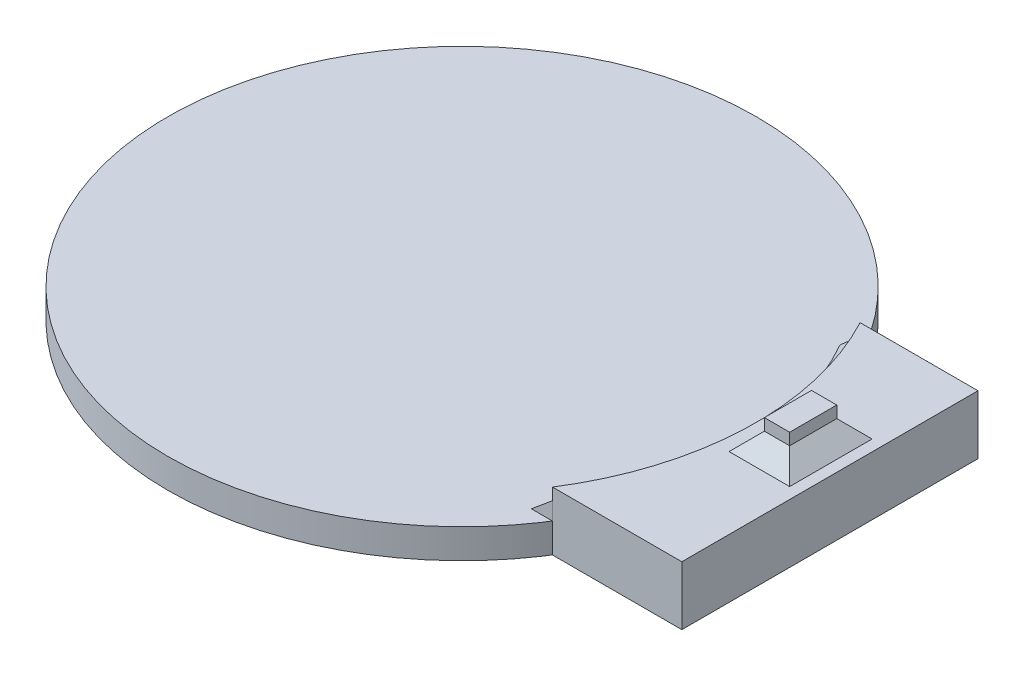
ISO-10303-21;
HEADER;
FILE_DESCRIPTION(('STEP AP214'),'2;1');
FILE_NAME('part.step','',(''),(''),'','','');
FILE_SCHEMA(('AUTOMOTIVE_DESIGN { 1 0 10303 214 1 1 1 1 }'));
ENDSEC;
DATA;
#1=APPLICATION_CONTEXT('core data for automotive mechanical design processes');
#2=APPLICATION_PROTOCOL_DEFINITION('international standard','automotive_design',2000,#1);
#3=PRODUCT_CONTEXT('',#1,'mechanical');
#4=PRODUCT('Part','Part','',(#3));
#5=PRODUCT_RELATED_PRODUCT_CATEGORY('part','',(#4));
#6=PRODUCT_DEFINITION_FORMATION('','',#4);
#7=PRODUCT_DEFINITION_CONTEXT('part definition',#1,'design');
#8=PRODUCT_DEFINITION('design','',#6,#7);
#9=PRODUCT_DEFINITION_SHAPE('','',#8);
#10=(LENGTH_UNIT() NAMED_UNIT(*) SI_UNIT(.MILLI.,.METRE.));
#11=(NAMED_UNIT(*) PLANE_ANGLE_UNIT() SI_UNIT($,.RADIAN.));
#12=(NAMED_UNIT(*) SI_UNIT($,.STERADIAN.) SOLID_ANGLE_UNIT());
#13=UNCERTAINTY_MEASURE_WITH_UNIT(LENGTH_MEASURE(1.E-05),#10,'distance_accuracy_value','');
#14=(GEOMETRIC_REPRESENTATION_CONTEXT(3) GLOBAL_UNCERTAINTY_ASSIGNED_CONTEXT((#13)) GLOBAL_UNIT_ASSIGNED_CONTEXT((#10,
#11,#12)) REPRESENTATION_CONTEXT('',''));
#15=CARTESIAN_POINT('',(0.,0.,0.));
#16=DIRECTION('',(0.,0.,1.));
#17=DIRECTION('',(1.,0.,0.));
#18=AXIS2_PLACEMENT_3D('',#15,#16,#17);
#19=CARTESIAN_POINT('',(51.9713163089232,10.,0.));
#20=DIRECTION('',(0.707106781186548,-0.707106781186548,0.));
#21=DIRECTION('',(0.707106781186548,0.707106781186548,0.));
#22=AXIS2_PLACEMENT_3D('',#19,#20,#21);
#23=PLANE('',#22);
#24=DIRECTION('',(-0.577350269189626,-0.577350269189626,0.577350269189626));
#25=VECTOR('',#24,1.);
#26=CARTESIAN_POINT('',(34.6475442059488,-7.32377210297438,23.9273230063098));
#27=LINE('',#26,#25);
#28=CARTESIAN_POINT('',(54.9713163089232,13.,3.60355090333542));
#29=VERTEX_POINT('',#28);
#30=CARTESIAN_POINT('',(51.9713163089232,10.,6.60355090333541));
#31=VERTEX_POINT('',#30);
#32=EDGE_CURVE('E130',#29,#31,#27,.T.);
#33=ORIENTED_EDGE('',*,*,#32,.F.);
#34=DIRECTION('',(0.,0.,1.));
#35=VECTOR('',#34,1.);
#36=CARTESIAN_POINT('',(54.9713163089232,13.,3.60355090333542));
#37=LINE('',#36,#35);
#38=CARTESIAN_POINT('',(54.9713163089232,13.,-4.40214039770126));
#39=VERTEX_POINT('',#38);
#40=EDGE_CURVE('E51',#39,#29,#37,.T.);
#41=ORIENTED_EDGE('',*,*,#40,.F.);
#42=DIRECTION('',(-0.577350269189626,-0.577350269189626,-0.577350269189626));
#43=VECTOR('',#42,1.);
#44=CARTESIAN_POINT('',(54.4386964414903,12.4673801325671,-4.93476026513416));
#45=LINE('',#44,#43);
#46=CARTESIAN_POINT('',(51.9713163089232,10.,-7.40214039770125));
#47=VERTEX_POINT('',#46);
#48=EDGE_CURVE('E133',#47,#39,#45,.F.);
#49=ORIENTED_EDGE('',*,*,#48,.F.);
#50=DIRECTION('',(0.,0.,-1.));
#51=VECTOR('',#50,1.);
#52=CARTESIAN_POINT('',(51.9713163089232,10.,0.));
#53=LINE('',#52,#51);
#54=EDGE_CURVE('E138',#31,#47,#53,.T.);
#55=ORIENTED_EDGE('',*,*,#54,.F.);
#56=EDGE_LOOP('',(#33,#41,#49,#55));
#57=FACE_BOUND('',#56,.T.);
#58=ADVANCED_FACE('F44',(#57),#23,.F.);
#59=CARTESIAN_POINT('',(0.,10.,-7.40214039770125));
#60=DIRECTION('',(0.,-0.707106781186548,0.707106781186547));
#61=DIRECTION('',(0.,-0.707106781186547,-0.707106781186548));
#62=AXIS2_PLACEMENT_3D('',#59,#60,#61);
#63=PLANE('',#62);
#64=ORIENTED_EDGE('',*,*,#48,.T.);
#65=DIRECTION('',(-1.,0.,0.));
#66=VECTOR('',#65,1.);
#67=CARTESIAN_POINT('',(54.9713163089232,13.,-4.40214039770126));
#68=LINE('',#67,#66);
#69=CARTESIAN_POINT('',(59.2700852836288,13.,-4.40214039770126));
#70=VERTEX_POINT('',#69);
#71=EDGE_CURVE('E145',#70,#39,#68,.T.);
#72=ORIENTED_EDGE('',*,*,#71,.F.);
#73=DIRECTION('',(0.577350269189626,-0.577350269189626,-0.577350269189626));
#74=VECTOR('',#73,1.);
#75=CARTESIAN_POINT('',(41.5133901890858,30.7566950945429,13.3545546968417));
#76=LINE('',#75,#74);
#77=CARTESIAN_POINT('',(62.2700852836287,10.,-7.40214039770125));
#78=VERTEX_POINT('',#77);
#79=EDGE_CURVE('E127',#78,#70,#76,.F.);
#80=ORIENTED_EDGE('',*,*,#79,.F.);
#81=DIRECTION('',(1.,0.,0.));
#82=VECTOR('',#81,1.);
#83=CARTESIAN_POINT('',(0.,10.,-7.40214039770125));
#84=LINE('',#83,#82);
#85=EDGE_CURVE('E65',#47,#78,#84,.T.);
#86=ORIENTED_EDGE('',*,*,#85,.F.);
#87=EDGE_LOOP('',(#64,#72,#80,#86));
#88=FACE_BOUND('',#87,.T.);
#89=ADVANCED_FACE('F165',(#88),#63,.F.);
#90=CARTESIAN_POINT('',(0.,10.,6.60355090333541));
#91=DIRECTION('',(0.,-0.707106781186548,-0.707106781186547));
#92=DIRECTION('',(0.,0.707106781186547,-0.707106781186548));
#93=AXIS2_PLACEMENT_3D('',#90,#91,#92);
#94=PLANE('',#93);
#95=ORIENTED_EDGE('',*,*,#32,.T.);
#96=DIRECTION('',(-1.,0.,0.));
#97=VECTOR('',#96,1.);
#98=CARTESIAN_POINT('',(0.,10.,6.60355090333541));
#99=LINE('',#98,#97);
#100=CARTESIAN_POINT('',(62.2700852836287,10.,6.60355090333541));
#101=VERTEX_POINT('',#100);
#102=EDGE_CURVE('E136',#101,#31,#99,.T.);
#103=ORIENTED_EDGE('',*,*,#102,.F.);
#104=DIRECTION('',(-0.577350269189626,0.577350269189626,-0.577350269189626));
#105=VECTOR('',#104,1.);
#106=CARTESIAN_POINT('',(41.5133901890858,30.7566950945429,-14.1531441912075));
#107=LINE('',#106,#105);
#108=CARTESIAN_POINT('',(59.2700852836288,13.,3.60355090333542));
#109=VERTEX_POINT('',#108);
#110=EDGE_CURVE('E124',#109,#101,#107,.F.);
#111=ORIENTED_EDGE('',*,*,#110,.F.);
#112=DIRECTION('',(1.,0.,0.));
#113=VECTOR('',#112,1.);
#114=CARTESIAN_POINT('',(54.9713163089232,13.,3.60355090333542));
#115=LINE('',#114,#113);
#116=EDGE_CURVE('E12',#29,#109,#115,.T.);
#117=ORIENTED_EDGE('',*,*,#116,.F.);
#118=EDGE_LOOP('',(#95,#103,#111,#117));
#119=FACE_BOUND('',#118,.T.);
#120=ADVANCED_FACE('F157',(#119),#94,.F.);
#121=CARTESIAN_POINT('',(62.2700852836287,10.,0.));
#122=DIRECTION('',(-0.707106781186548,-0.707106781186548,0.));
#123=DIRECTION('',(0.707106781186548,-0.707106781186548,0.));
#124=AXIS2_PLACEMENT_3D('',#121,#122,#123);
#125=PLANE('',#124);
#126=ORIENTED_EDGE('',*,*,#79,.T.);
#127=DIRECTION('',(0.,0.,-1.));
#128=VECTOR('',#127,1.);
#129=CARTESIAN_POINT('',(59.2700852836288,13.,3.60355090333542));
#130=LINE('',#129,#128);
#131=EDGE_CURVE('E143',#109,#70,#130,.T.);
#132=ORIENTED_EDGE('',*,*,#131,.F.);
#133=ORIENTED_EDGE('',*,*,#110,.T.);
#134=DIRECTION('',(0.,0.,1.));
#135=VECTOR('',#134,1.);
#136=CARTESIAN_POINT('',(62.2700852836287,10.,0.));
#137=LINE('',#136,#135);
#138=EDGE_CURVE('E141',#78,#101,#137,.T.);
#139=ORIENTED_EDGE('',*,*,#138,.F.);
#140=EDGE_LOOP('',(#126,#132,#133,#139));
#141=FACE_BOUND('',#140,.T.);
#142=ADVANCED_FACE('F160',(#141),#125,.F.);
#143=CARTESIAN_POINT('',(54.9713163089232,15.,3.60355090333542));
#144=DIRECTION('',(1.,0.,0.));
#145=DIRECTION('',(0.,0.,-1.));
#146=AXIS2_PLACEMENT_3D('',#143,#144,#145);
#147=PLANE('',#146);
#148=ORIENTED_EDGE('',*,*,#40,.T.);
#149=DIRECTION('',(0.,-1.,0.));
#150=VECTOR('',#149,1.);
#151=CARTESIAN_POINT('',(54.9713163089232,15.,3.60355090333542));
#152=LINE('',#151,#150);
#153=CARTESIAN_POINT('',(54.9713163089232,10.,3.60355090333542));
#154=VERTEX_POINT('',#153);
#155=EDGE_CURVE('E100',#29,#154,#152,.T.);
#156=ORIENTED_EDGE('',*,*,#155,.T.);
#157=DIRECTION('',(0.,0.,-1.));
#158=VECTOR('',#157,1.);
#159=CARTESIAN_POINT('',(54.9713163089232,10.,0.));
#160=LINE('',#159,#158);
#161=CARTESIAN_POINT('',(54.9713163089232,10.,-4.40214039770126));
#162=VERTEX_POINT('',#161);
#163=EDGE_CURVE('E111',#154,#162,#160,.T.);
#164=ORIENTED_EDGE('',*,*,#163,.T.);
#165=DIRECTION('',(0.,-1.,0.));
#166=VECTOR('',#165,1.);
#167=CARTESIAN_POINT('',(54.9713163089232,15.,-4.40214039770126));
#168=LINE('',#167,#166);
#169=EDGE_CURVE('E121',#39,#162,#168,.T.);
#170=ORIENTED_EDGE('',*,*,#169,.F.);
#171=EDGE_LOOP('',(#148,#156,#164,#170));
#172=FACE_BOUND('',#171,.T.);
#173=ADVANCED_FACE('F149',(#172),#147,.T.);
#174=CARTESIAN_POINT('',(54.9713163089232,15.,-4.40214039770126));
#175=DIRECTION('',(0.,0.,1.));
#176=DIRECTION('',(1.,0.,0.));
#177=AXIS2_PLACEMENT_3D('',#174,#175,#176);
#178=PLANE('',#177);
#179=ORIENTED_EDGE('',*,*,#71,.T.);
#180=ORIENTED_EDGE('',*,*,#169,.T.);
#181=DIRECTION('',(1.,0.,0.));
#182=VECTOR('',#181,1.);
#183=CARTESIAN_POINT('',(0.,10.,-4.40214039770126));
#184=LINE('',#183,#182);
#185=CARTESIAN_POINT('',(59.2700852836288,10.,-4.40214039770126));
#186=VERTEX_POINT('',#185);
#187=EDGE_CURVE('E115',#162,#186,#184,.T.);
#188=ORIENTED_EDGE('',*,*,#187,.T.);
#189=DIRECTION('',(0.,-1.,0.));
#190=VECTOR('',#189,1.);
#191=CARTESIAN_POINT('',(59.2700852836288,15.,-4.40214039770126));
#192=LINE('',#191,#190);
#193=EDGE_CURVE('E101',#70,#186,#192,.T.);
#194=ORIENTED_EDGE('',*,*,#193,.F.);
#195=EDGE_LOOP('',(#179,#180,#188,#194));
#196=FACE_BOUND('',#195,.T.);
#197=ADVANCED_FACE('F163',(#196),#178,.T.);
#198=CARTESIAN_POINT('',(54.9713163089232,15.,3.60355090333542));
#199=DIRECTION('',(0.,0.,-1.));
#200=DIRECTION('',(-1.,0.,0.));
#201=AXIS2_PLACEMENT_3D('',#198,#199,#200);
#202=PLANE('',#201);
#203=ORIENTED_EDGE('',*,*,#116,.T.);
#204=DIRECTION('',(0.,-1.,0.));
#205=VECTOR('',#204,1.);
#206=CARTESIAN_POINT('',(59.2700852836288,15.,3.60355090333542));
#207=LINE('',#206,#205);
#208=CARTESIAN_POINT('',(59.2700852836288,10.,3.60355090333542));
#209=VERTEX_POINT('',#208);
#210=EDGE_CURVE('E58',#109,#209,#207,.T.);
#211=ORIENTED_EDGE('',*,*,#210,.T.);
#212=DIRECTION('',(-1.,0.,0.));
#213=VECTOR('',#212,1.);
#214=CARTESIAN_POINT('',(0.,10.,3.60355090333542));
#215=LINE('',#214,#213);
#216=EDGE_CURVE('E97',#209,#154,#215,.T.);
#217=ORIENTED_EDGE('',*,*,#216,.T.);
#218=ORIENTED_EDGE('',*,*,#155,.F.);
#219=EDGE_LOOP('',(#203,#211,#217,#218));
#220=FACE_BOUND('',#219,.T.);
#221=ADVANCED_FACE('F95',(#220),#202,.T.);
#222=CARTESIAN_POINT('',(0.,10.,0.));
#223=DIRECTION('',(0.,1.,0.));
#224=DIRECTION('',(0.,0.,1.));
#225=AXIS2_PLACEMENT_3D('',#222,#223,#224);
#226=PLANE('',#225);
#227=ORIENTED_EDGE('',*,*,#216,.F.);
#228=DIRECTION('',(0.,0.,1.));
#229=VECTOR('',#228,1.);
#230=CARTESIAN_POINT('',(59.2700852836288,10.,0.));
#231=LINE('',#230,#229);
#232=EDGE_CURVE('E108',#186,#209,#231,.T.);
#233=ORIENTED_EDGE('',*,*,#232,.F.);
#234=ORIENTED_EDGE('',*,*,#187,.F.);
#235=ORIENTED_EDGE('',*,*,#163,.F.);
#236=EDGE_LOOP('',(#227,#233,#234,#235));
#237=FACE_BOUND('',#236,.T.);
#238=ORIENTED_EDGE('',*,*,#85,.T.);
#239=ORIENTED_EDGE('',*,*,#138,.T.);
#240=ORIENTED_EDGE('',*,*,#102,.T.);
#241=ORIENTED_EDGE('',*,*,#54,.T.);
#242=EDGE_LOOP('',(#238,#239,#240,#241));
#243=FACE_BOUND('',#242,.T.);
#244=ADVANCED_FACE('F106',(#237,#243),#226,.F.);
#245=CARTESIAN_POINT('',(59.2700852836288,15.,3.60355090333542));
#246=DIRECTION('',(-1.,0.,0.));
#247=DIRECTION('',(0.,0.,1.));
#248=AXIS2_PLACEMENT_3D('',#245,#246,#247);
#249=PLANE('',#248);
#250=ORIENTED_EDGE('',*,*,#131,.T.);
#251=ORIENTED_EDGE('',*,*,#193,.T.);
#252=ORIENTED_EDGE('',*,*,#232,.T.);
#253=ORIENTED_EDGE('',*,*,#210,.F.);
#254=EDGE_LOOP('',(#250,#251,#252,#253));
#255=FACE_BOUND('',#254,.T.);
#256=ADVANCED_FACE('F113',(#255),#249,.T.);
#257=CLOSED_SHELL('',(#58,#89,#120,#142,#173,#197,#221,#244,#256));
#258=MANIFOLD_SOLID_BREP('B2',#257);
#259=CARTESIAN_POINT('',(64.1693493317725,10.,-23.5001463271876));
#260=DIRECTION('',(0.,0.,1.));
#261=DIRECTION('',(1.,0.,0.));
#262=AXIS2_PLACEMENT_3D('',#259,#260,#261);
#263=PLANE('',#262);
#264=DIRECTION('',(0.,-1.,0.));
#265=VECTOR('',#264,1.);
#266=CARTESIAN_POINT('',(44.1332428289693,10.,-23.5001463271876));
#267=LINE('',#266,#265);
#268=CARTESIAN_POINT('',(44.1332428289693,7.99999999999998,-23.5001463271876));
#269=VERTEX_POINT('',#268);
#270=CARTESIAN_POINT('',(44.1332428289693,5.,-23.5001463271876));
#271=VERTEX_POINT('',#270);
#272=EDGE_CURVE('E269',#269,#271,#267,.T.);
#273=ORIENTED_EDGE('',*,*,#272,.T.);
#274=DIRECTION('',(1.,0.,0.));
#275=VECTOR('',#274,1.);
#276=CARTESIAN_POINT('',(0.,5.,-23.5001463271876));
#277=LINE('',#276,#275);
#278=CARTESIAN_POINT('',(40.7031094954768,5.,-23.5001463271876));
#279=VERTEX_POINT('',#278);
#280=EDGE_CURVE('E288',#279,#271,#277,.T.);
#281=ORIENTED_EDGE('',*,*,#280,.F.);
#282=CARTESIAN_POINT('',(40.7031094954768,5.,-23.5001463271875));
#283=CARTESIAN_POINT('',(40.9901723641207,5.2486040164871,-23.5001463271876));
#284=CARTESIAN_POINT('',(41.27691054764,5.49758274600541,-23.5001463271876));
#285=CARTESIAN_POINT('',(41.8497667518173,5.99624945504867,-23.5001463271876));
#286=CARTESIAN_POINT('',(42.1358847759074,6.24593743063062,-23.5001463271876));
#287=CARTESIAN_POINT('',(42.7075329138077,6.74598509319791,-23.5001463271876));
#288=CARTESIAN_POINT('',(42.9930630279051,6.99634477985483,-23.5001463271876));
#289=CARTESIAN_POINT('',(43.5635650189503,7.49770259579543,-23.5001463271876));
#290=CARTESIAN_POINT('',(43.848536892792,7.74870072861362,-23.5001463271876));
#291=CARTESIAN_POINT('',(44.1332428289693,7.99999999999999,-23.5001463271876));
#292=B_SPLINE_CURVE_WITH_KNOTS('',3,(#282,#283,#284,#285,#286,#287,#288,#289,#290,#291),
.UNSPECIFIED.,.F.,.F.,(4,2,2,2,4),(0.,1.13924547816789,2.27848463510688,3.4177232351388,
4.55696815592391),.UNSPECIFIED.);
#293=EDGE_CURVE('E262',#279,#269,#292,.T.);
#294=ORIENTED_EDGE('',*,*,#293,.T.);
#295=EDGE_LOOP('',(#273,#281,#294));
#296=FACE_BOUND('',#295,.T.);
#297=ADVANCED_FACE('F249',(#296),#263,.F.);
#298=CARTESIAN_POINT('',(64.1693493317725,10.,26.8266510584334));
#299=DIRECTION('',(0.,0.,-1.));
#300=DIRECTION('',(-1.,0.,0.));
#301=AXIS2_PLACEMENT_3D('',#298,#299,#300);
#302=PLANE('',#301);
#303=DIRECTION('',(0.,-1.,0.));
#304=VECTOR('',#303,1.);
#305=CARTESIAN_POINT('',(42.1939663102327,10.,26.8266510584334));
#306=LINE('',#305,#304);
#307=CARTESIAN_POINT('',(42.1939663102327,7.99999999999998,26.8266510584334));
#308=VERTEX_POINT('',#307);
#309=CARTESIAN_POINT('',(42.1939663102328,5.,26.8266510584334));
#310=VERTEX_POINT('',#309);
#311=EDGE_CURVE('E299',#308,#310,#306,.T.);
#312=ORIENTED_EDGE('',*,*,#311,.F.);
#313=CARTESIAN_POINT('',(42.1939663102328,7.99999999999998,26.8266510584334));
#314=CARTESIAN_POINT('',(41.8954121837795,7.74805735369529,26.8266510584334));
#315=CARTESIAN_POINT('',(41.5964794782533,7.49656298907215,26.8266510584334));
#316=CARTESIAN_POINT('',(40.9978197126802,6.994528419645,26.8266510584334));
#317=CARTESIAN_POINT('',(40.6980926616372,6.74398820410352,26.8266510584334));
#318=CARTESIAN_POINT('',(40.0977999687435,6.24391358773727,26.8266510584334));
#319=CARTESIAN_POINT('',(39.7972343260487,5.99437918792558,26.8266510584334));
#320=CARTESIAN_POINT('',(39.1952166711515,5.49637503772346,26.8266510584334));
#321=CARTESIAN_POINT('',(38.8937646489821,5.24790529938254,26.8266510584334));
#322=CARTESIAN_POINT('',(38.5918487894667,5.00000000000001,26.8266510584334));
#323=B_SPLINE_CURVE_WITH_KNOTS('',3,(#313,#314,#315,#316,#317,#318,#319,#320,#321,#322),
.UNSPECIFIED.,.F.,.F.,(4,2,2,2,4),(0.,1.17195847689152,2.3439037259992,3.51585015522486,
4.68780981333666),.UNSPECIFIED.);
#324=CARTESIAN_POINT('',(38.5918487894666,5.,26.8266510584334));
#325=VERTEX_POINT('',#324);
#326=EDGE_CURVE('E42',#308,#325,#323,.T.);
#327=ORIENTED_EDGE('',*,*,#326,.T.);
#328=DIRECTION('',(-1.,0.,0.));
#329=VECTOR('',#328,1.);
#330=CARTESIAN_POINT('',(0.,5.,26.8266510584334));
#331=LINE('',#330,#329);
#332=EDGE_CURVE('E277',#310,#325,#331,.T.);
#333=ORIENTED_EDGE('',*,*,#332,.F.);
#334=EDGE_LOOP('',(#312,#327,#333));
#335=FACE_BOUND('',#334,.T.);
#336=ADVANCED_FACE('F251',(#335),#302,.F.);
#337=CARTESIAN_POINT('',(0.,5.,0.));
#338=DIRECTION('',(0.,1.,0.));
#339=DIRECTION('',(0.,0.,1.));
#340=AXIS2_PLACEMENT_3D('',#337,#338,#339);
#341=CONICAL_SURFACE('',#340,47.,0.785398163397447);
#342=ORIENTED_EDGE('',*,*,#326,.F.);
#343=CARTESIAN_POINT('',(0.,7.99999999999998,0.));
#344=DIRECTION('',(0.,1.,0.));
#345=DIRECTION('',(0.,0.,1.));
#346=AXIS2_PLACEMENT_3D('',#343,#344,#345);
#347=CIRCLE('',#346,50.);
#348=EDGE_CURVE('E295',#269,#308,#347,.F.);
#349=ORIENTED_EDGE('',*,*,#348,.F.);
#350=ORIENTED_EDGE('',*,*,#293,.F.);
#351=CARTESIAN_POINT('',(0.,5.,0.));
#352=DIRECTION('',(0.,1.,0.));
#353=DIRECTION('',(0.,0.,1.));
#354=AXIS2_PLACEMENT_3D('',#351,#352,#353);
#355=CIRCLE('',#354,47.);
#356=EDGE_CURVE('E292',#325,#279,#355,.T.);
#357=ORIENTED_EDGE('',*,*,#356,.F.);
#358=EDGE_LOOP('',(#342,#349,#350,#357));
#359=FACE_BOUND('',#358,.T.);
#360=ADVANCED_FACE('F311',(#359),#341,.F.);
#361=CARTESIAN_POINT('',(0.,5.,0.));
#362=DIRECTION('',(0.,1.,0.));
#363=DIRECTION('',(0.,0.,1.));
#364=AXIS2_PLACEMENT_3D('',#361,#362,#363);
#365=PLANE('',#364);
#366=CARTESIAN_POINT('',(0.,5.,0.));
#367=DIRECTION('',(0.,1.,0.));
#368=DIRECTION('',(0.,0.,1.));
#369=AXIS2_PLACEMENT_3D('',#366,#367,#368);
#370=CIRCLE('',#369,50.);
#371=EDGE_CURVE('E290',#310,#271,#370,.T.);
#372=ORIENTED_EDGE('',*,*,#371,.F.);
#373=ORIENTED_EDGE('',*,*,#332,.T.);
#374=ORIENTED_EDGE('',*,*,#356,.T.);
#375=ORIENTED_EDGE('',*,*,#280,.T.);
#376=EDGE_LOOP('',(#372,#373,#374,#375));
#377=FACE_BOUND('',#376,.T.);
#378=ADVANCED_FACE('F289',(#377),#365,.F.);
#379=CARTESIAN_POINT('',(0.,10.,0.));
#380=DIRECTION('',(0.,-1.,0.));
#381=DIRECTION('',(0.,0.,-1.));
#382=AXIS2_PLACEMENT_3D('',#379,#380,#381);
#383=CYLINDRICAL_SURFACE('',#382,50.);
#384=ORIENTED_EDGE('',*,*,#348,.T.);
#385=ORIENTED_EDGE('',*,*,#311,.T.);
#386=ORIENTED_EDGE('',*,*,#371,.T.);
#387=ORIENTED_EDGE('',*,*,#272,.F.);
#388=EDGE_LOOP('',(#384,#385,#386,#387));
#389=FACE_BOUND('',#388,.T.);
#390=ADVANCED_FACE('F297',(#389),#383,.T.);
#391=CLOSED_SHELL('',(#297,#336,#360,#378,#390));
#392=MANIFOLD_SOLID_BREP('B6',#391);
#393=CARTESIAN_POINT('',(54.9713163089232,15.,3.60355090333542));
#394=DIRECTION('',(1.,0.,0.));
#395=DIRECTION('',(0.,0.,-1.));
#396=AXIS2_PLACEMENT_3D('',#393,#394,#395);
#397=PLANE('',#396);
#398=DIRECTION('',(0.,0.,1.));
#399=VECTOR('',#398,1.);
#400=CARTESIAN_POINT('',(54.9713163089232,10.,3.60355090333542));
#401=LINE('',#400,#399);
#402=CARTESIAN_POINT('',(54.9713163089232,10.,-4.40214039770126));
#403=VERTEX_POINT('',#402);
#404=CARTESIAN_POINT('',(54.9713163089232,10.,3.60355090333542));
#405=VERTEX_POINT('',#404);
#406=EDGE_CURVE('E411',#403,#405,#401,.T.);
#407=ORIENTED_EDGE('',*,*,#406,.T.);
#408=DIRECTION('',(0.,-1.,0.));
#409=VECTOR('',#408,1.);
#410=CARTESIAN_POINT('',(54.9713163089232,15.,3.60355090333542));
#411=LINE('',#410,#409);
#412=CARTESIAN_POINT('',(54.9713163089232,15.,3.60355090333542));
#413=VERTEX_POINT('',#412);
#414=EDGE_CURVE('E247',#413,#405,#411,.T.);
#415=ORIENTED_EDGE('',*,*,#414,.F.);
#416=DIRECTION('',(0.,0.,1.));
#417=VECTOR('',#416,1.);
#418=CARTESIAN_POINT('',(54.9713163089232,15.,3.60355090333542));
#419=LINE('',#418,#417);
#420=CARTESIAN_POINT('',(54.9713163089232,15.,-4.40214039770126));
#421=VERTEX_POINT('',#420);
#422=EDGE_CURVE('E429',#421,#413,#419,.T.);
#423=ORIENTED_EDGE('',*,*,#422,.F.);
#424=DIRECTION('',(0.,-1.,0.));
#425=VECTOR('',#424,1.);
#426=CARTESIAN_POINT('',(54.9713163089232,15.,-4.40214039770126));
#427=LINE('',#426,#425);
#428=EDGE_CURVE('E423',#421,#403,#427,.T.);
#429=ORIENTED_EDGE('',*,*,#428,.T.);
#430=EDGE_LOOP('',(#407,#415,#423,#429));
#431=FACE_BOUND('',#430,.T.);
#432=ADVANCED_FACE('F367',(#431),#397,.F.);
#433=CARTESIAN_POINT('',(54.9713163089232,15.,3.60355090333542));
#434=DIRECTION('',(0.,0.,-1.));
#435=DIRECTION('',(-1.,0.,0.));
#436=AXIS2_PLACEMENT_3D('',#433,#434,#435);
#437=PLANE('',#436);
#438=DIRECTION('',(1.,0.,0.));
#439=VECTOR('',#438,1.);
#440=CARTESIAN_POINT('',(54.9713163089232,10.,3.60355090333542));
#441=LINE('',#440,#439);
#442=CARTESIAN_POINT('',(59.2700852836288,10.,3.60355090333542));
#443=VERTEX_POINT('',#442);
#444=EDGE_CURVE('E407',#405,#443,#441,.T.);
#445=ORIENTED_EDGE('',*,*,#444,.T.);
#446=DIRECTION('',(0.,-1.,0.));
#447=VECTOR('',#446,1.);
#448=CARTESIAN_POINT('',(59.2700852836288,15.,3.60355090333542));
#449=LINE('',#448,#447);
#450=CARTESIAN_POINT('',(59.2700852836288,15.,3.60355090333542));
#451=VERTEX_POINT('',#450);
#452=EDGE_CURVE('E374',#451,#443,#449,.T.);
#453=ORIENTED_EDGE('',*,*,#452,.F.);
#454=DIRECTION('',(1.,0.,0.));
#455=VECTOR('',#454,1.);
#456=CARTESIAN_POINT('',(54.9713163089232,15.,3.60355090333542));
#457=LINE('',#456,#455);
#458=EDGE_CURVE('E419',#413,#451,#457,.T.);
#459=ORIENTED_EDGE('',*,*,#458,.F.);
#460=ORIENTED_EDGE('',*,*,#414,.T.);
#461=EDGE_LOOP('',(#445,#453,#459,#460));
#462=FACE_BOUND('',#461,.T.);
#463=ADVANCED_FACE('F418',(#462),#437,.F.);
#464=CARTESIAN_POINT('',(59.2700852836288,15.,3.60355090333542));
#465=DIRECTION('',(-1.,0.,0.));
#466=DIRECTION('',(0.,0.,1.));
#467=AXIS2_PLACEMENT_3D('',#464,#465,#466);
#468=PLANE('',#467);
#469=DIRECTION('',(0.,0.,-1.));
#470=VECTOR('',#469,1.);
#471=CARTESIAN_POINT('',(59.2700852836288,10.,3.60355090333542));
#472=LINE('',#471,#470);
#473=CARTESIAN_POINT('',(59.2700852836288,10.,-4.40214039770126));
#474=VERTEX_POINT('',#473);
#475=EDGE_CURVE('E412',#443,#474,#472,.T.);
#476=ORIENTED_EDGE('',*,*,#475,.T.);
#477=DIRECTION('',(0.,-1.,0.));
#478=VECTOR('',#477,1.);
#479=CARTESIAN_POINT('',(59.2700852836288,15.,-4.40214039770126));
#480=LINE('',#479,#478);
#481=CARTESIAN_POINT('',(59.2700852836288,15.,-4.40214039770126));
#482=VERTEX_POINT('',#481);
#483=EDGE_CURVE('E435',#482,#474,#480,.T.);
#484=ORIENTED_EDGE('',*,*,#483,.F.);
#485=DIRECTION('',(0.,0.,-1.));
#486=VECTOR('',#485,1.);
#487=CARTESIAN_POINT('',(59.2700852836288,15.,3.60355090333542));
#488=LINE('',#487,#486);
#489=EDGE_CURVE('E386',#451,#482,#488,.T.);
#490=ORIENTED_EDGE('',*,*,#489,.F.);
#491=ORIENTED_EDGE('',*,*,#452,.T.);
#492=EDGE_LOOP('',(#476,#484,#490,#491));
#493=FACE_BOUND('',#492,.T.);
#494=ADVANCED_FACE('F438',(#493),#468,.F.);
#495=CARTESIAN_POINT('',(54.9713163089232,15.,-4.40214039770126));
#496=DIRECTION('',(0.,0.,1.));
#497=DIRECTION('',(1.,0.,0.));
#498=AXIS2_PLACEMENT_3D('',#495,#496,#497);
#499=PLANE('',#498);
#500=DIRECTION('',(-1.,0.,0.));
#501=VECTOR('',#500,1.);
#502=CARTESIAN_POINT('',(54.9713163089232,10.,-4.40214039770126));
#503=LINE('',#502,#501);
#504=EDGE_CURVE('E427',#474,#403,#503,.T.);
#505=ORIENTED_EDGE('',*,*,#504,.T.);
#506=ORIENTED_EDGE('',*,*,#428,.F.);
#507=DIRECTION('',(-1.,0.,0.));
#508=VECTOR('',#507,1.);
#509=CARTESIAN_POINT('',(54.9713163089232,15.,-4.40214039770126));
#510=LINE('',#509,#508);
#511=EDGE_CURVE('E381',#482,#421,#510,.T.);
#512=ORIENTED_EDGE('',*,*,#511,.F.);
#513=ORIENTED_EDGE('',*,*,#483,.T.);
#514=EDGE_LOOP('',(#505,#506,#512,#513));
#515=FACE_BOUND('',#514,.T.);
#516=ADVANCED_FACE('F440',(#515),#499,.F.);
#517=CARTESIAN_POINT('',(54.9713163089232,15.,-4.40214039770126));
#518=DIRECTION('',(0.,-1.,0.));
#519=DIRECTION('',(0.,0.,-1.));
#520=AXIS2_PLACEMENT_3D('',#517,#518,#519);
#521=PLANE('',#520);
#522=ORIENTED_EDGE('',*,*,#422,.T.);
#523=ORIENTED_EDGE('',*,*,#458,.T.);
#524=ORIENTED_EDGE('',*,*,#489,.T.);
#525=ORIENTED_EDGE('',*,*,#511,.T.);
#526=EDGE_LOOP('',(#522,#523,#524,#525));
#527=FACE_BOUND('',#526,.T.);
#528=ADVANCED_FACE('F441',(#527),#521,.F.);
#529=CARTESIAN_POINT('',(54.9713163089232,10.,-4.40214039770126));
#530=DIRECTION('',(0.,-1.,0.));
#531=DIRECTION('',(0.,0.,-1.));
#532=AXIS2_PLACEMENT_3D('',#529,#530,#531);
#533=PLANE('',#532);
#534=ORIENTED_EDGE('',*,*,#406,.F.);
#535=ORIENTED_EDGE('',*,*,#504,.F.);
#536=ORIENTED_EDGE('',*,*,#475,.F.);
#537=ORIENTED_EDGE('',*,*,#444,.F.);
#538=EDGE_LOOP('',(#534,#535,#536,#537));
#539=FACE_BOUND('',#538,.T.);
#540=ADVANCED_FACE('F408',(#539),#533,.T.);
#541=CLOSED_SHELL('',(#432,#463,#494,#516,#528,#540));
#542=MANIFOLD_SOLID_BREP('B36',#541);
#543=CARTESIAN_POINT('',(64.1693493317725,10.,-23.5001463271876));
#544=DIRECTION('',(-1.,0.,0.));
#545=DIRECTION('',(0.,0.,1.));
#546=AXIS2_PLACEMENT_3D('',#543,#544,#545);
#547=PLANE('',#546);
#548=DIRECTION('',(0.,0.,-1.));
#549=VECTOR('',#548,1.);
#550=CARTESIAN_POINT('',(64.1693493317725,0.,-23.5001463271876));
#551=LINE('',#550,#549);
#552=CARTESIAN_POINT('',(64.1693493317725,0.,26.8266510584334));
#553=VERTEX_POINT('',#552);
#554=CARTESIAN_POINT('',(64.1693493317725,0.,-23.5001463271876));
#555=VERTEX_POINT('',#554);
#556=EDGE_CURVE('E542',#553,#555,#551,.T.);
#557=ORIENTED_EDGE('',*,*,#556,.T.);
#558=DIRECTION('',(0.,-1.,0.));
#559=VECTOR('',#558,1.);
#560=CARTESIAN_POINT('',(64.1693493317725,10.,-23.5001463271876));
#561=LINE('',#560,#559);
#562=CARTESIAN_POINT('',(64.1693493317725,10.,-23.5001463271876));
#563=VERTEX_POINT('',#562);
#564=EDGE_CURVE('E365',#563,#555,#561,.T.);
#565=ORIENTED_EDGE('',*,*,#564,.F.);
#566=DIRECTION('',(0.,0.,-1.));
#567=VECTOR('',#566,1.);
#568=CARTESIAN_POINT('',(64.1693493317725,10.,-23.5001463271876));
#569=LINE('',#568,#567);
#570=CARTESIAN_POINT('',(64.1693493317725,10.,26.8266510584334));
#571=VERTEX_POINT('',#570);
#572=EDGE_CURVE('E560',#571,#563,#569,.T.);
#573=ORIENTED_EDGE('',*,*,#572,.F.);
#574=DIRECTION('',(0.,-1.,0.));
#575=VECTOR('',#574,1.);
#576=CARTESIAN_POINT('',(64.1693493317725,10.,26.8266510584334));
#577=LINE('',#576,#575);
#578=EDGE_CURVE('E554',#571,#553,#577,.T.);
#579=ORIENTED_EDGE('',*,*,#578,.T.);
#580=EDGE_LOOP('',(#557,#565,#573,#579));
#581=FACE_BOUND('',#580,.T.);
#582=ADVANCED_FACE('F498',(#581),#547,.F.);
#583=CARTESIAN_POINT('',(64.1693493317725,10.,-23.5001463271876));
#584=DIRECTION('',(0.,0.,1.));
#585=DIRECTION('',(1.,0.,0.));
#586=AXIS2_PLACEMENT_3D('',#583,#584,#585);
#587=PLANE('',#586);
#588=DIRECTION('',(-1.,0.,0.));
#589=VECTOR('',#588,1.);
#590=CARTESIAN_POINT('',(64.1693493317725,0.,-23.5001463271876));
#591=LINE('',#590,#589);
#592=CARTESIAN_POINT('',(44.1332428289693,0.,-23.5001463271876));
#593=VERTEX_POINT('',#592);
#594=EDGE_CURVE('E538',#555,#593,#591,.T.);
#595=ORIENTED_EDGE('',*,*,#594,.T.);
#596=DIRECTION('',(0.,-1.,0.));
#597=VECTOR('',#596,1.);
#598=CARTESIAN_POINT('',(44.1332428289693,10.,-23.5001463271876));
#599=LINE('',#598,#597);
#600=CARTESIAN_POINT('',(44.1332428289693,10.,-23.5001463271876));
#601=VERTEX_POINT('',#600);
#602=EDGE_CURVE('E505',#601,#593,#599,.T.);
#603=ORIENTED_EDGE('',*,*,#602,.F.);
#604=DIRECTION('',(-1.,0.,0.));
#605=VECTOR('',#604,1.);
#606=CARTESIAN_POINT('',(64.1693493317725,10.,-23.5001463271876));
#607=LINE('',#606,#605);
#608=EDGE_CURVE('E550',#563,#601,#607,.T.);
#609=ORIENTED_EDGE('',*,*,#608,.F.);
#610=ORIENTED_EDGE('',*,*,#564,.T.);
#611=EDGE_LOOP('',(#595,#603,#609,#610));
#612=FACE_BOUND('',#611,.T.);
#613=ADVANCED_FACE('F549',(#612),#587,.F.);
#614=CARTESIAN_POINT('',(0.,10.,0.));
#615=DIRECTION('',(0.,-1.,0.));
#616=DIRECTION('',(0.,0.,-1.));
#617=AXIS2_PLACEMENT_3D('',#614,#615,#616);
#618=CYLINDRICAL_SURFACE('',#617,50.);
#619=CARTESIAN_POINT('',(0.,0.,0.));
#620=DIRECTION('',(0.,-1.,0.));
#621=DIRECTION('',(0.,0.,1.));
#622=AXIS2_PLACEMENT_3D('',#619,#620,#621);
#623=CIRCLE('',#622,50.);
#624=CARTESIAN_POINT('',(42.1939663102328,0.,26.8266510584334));
#625=VERTEX_POINT('',#624);
#626=EDGE_CURVE('E543',#593,#625,#623,.T.);
#627=ORIENTED_EDGE('',*,*,#626,.T.);
#628=DIRECTION('',(0.,-1.,0.));
#629=VECTOR('',#628,1.);
#630=CARTESIAN_POINT('',(42.1939663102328,10.,26.8266510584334));
#631=LINE('',#630,#629);
#632=CARTESIAN_POINT('',(42.1939663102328,10.,26.8266510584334));
#633=VERTEX_POINT('',#632);
#634=EDGE_CURVE('E566',#633,#625,#631,.T.);
#635=ORIENTED_EDGE('',*,*,#634,.F.);
#636=CARTESIAN_POINT('',(0.,10.,0.));
#637=DIRECTION('',(0.,-1.,0.));
#638=DIRECTION('',(0.,0.,1.));
#639=AXIS2_PLACEMENT_3D('',#636,#637,#638);
#640=CIRCLE('',#639,50.);
#641=EDGE_CURVE('E517',#601,#633,#640,.T.);
#642=ORIENTED_EDGE('',*,*,#641,.F.);
#643=ORIENTED_EDGE('',*,*,#602,.T.);
#644=EDGE_LOOP('',(#627,#635,#642,#643));
#645=FACE_BOUND('',#644,.T.);
#646=ADVANCED_FACE('F569',(#645),#618,.F.);
#647=CARTESIAN_POINT('',(64.1693493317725,10.,26.8266510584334));
#648=DIRECTION('',(0.,0.,-1.));
#649=DIRECTION('',(-1.,0.,0.));
#650=AXIS2_PLACEMENT_3D('',#647,#648,#649);
#651=PLANE('',#650);
#652=DIRECTION('',(1.,0.,0.));
#653=VECTOR('',#652,1.);
#654=CARTESIAN_POINT('',(64.1693493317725,0.,26.8266510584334));
#655=LINE('',#654,#653);
#656=EDGE_CURVE('E558',#625,#553,#655,.T.);
#657=ORIENTED_EDGE('',*,*,#656,.T.);
#658=ORIENTED_EDGE('',*,*,#578,.F.);
#659=DIRECTION('',(1.,0.,0.));
#660=VECTOR('',#659,1.);
#661=CARTESIAN_POINT('',(64.1693493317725,10.,26.8266510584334));
#662=LINE('',#661,#660);
#663=EDGE_CURVE('E512',#633,#571,#662,.T.);
#664=ORIENTED_EDGE('',*,*,#663,.F.);
#665=ORIENTED_EDGE('',*,*,#634,.T.);
#666=EDGE_LOOP('',(#657,#658,#664,#665));
#667=FACE_BOUND('',#666,.T.);
#668=ADVANCED_FACE('F571',(#667),#651,.F.);
#669=CARTESIAN_POINT('',(0.,10.,0.));
#670=DIRECTION('',(0.,1.,0.));
#671=DIRECTION('',(0.,0.,1.));
#672=AXIS2_PLACEMENT_3D('',#669,#670,#671);
#673=PLANE('',#672);
#674=ORIENTED_EDGE('',*,*,#572,.T.);
#675=ORIENTED_EDGE('',*,*,#608,.T.);
#676=ORIENTED_EDGE('',*,*,#641,.T.);
#677=ORIENTED_EDGE('',*,*,#663,.T.);
#678=EDGE_LOOP('',(#674,#675,#676,#677));
#679=FACE_BOUND('',#678,.T.);
#680=ADVANCED_FACE('F572',(#679),#673,.T.);
#681=CARTESIAN_POINT('',(0.,0.,0.));
#682=DIRECTION('',(0.,1.,0.));
#683=DIRECTION('',(0.,0.,1.));
#684=AXIS2_PLACEMENT_3D('',#681,#682,#683);
#685=PLANE('',#684);
#686=ORIENTED_EDGE('',*,*,#556,.F.);
#687=ORIENTED_EDGE('',*,*,#656,.F.);
#688=ORIENTED_EDGE('',*,*,#626,.F.);
#689=ORIENTED_EDGE('',*,*,#594,.F.);
#690=EDGE_LOOP('',(#686,#687,#688,#689));
#691=FACE_BOUND('',#690,.T.);
#692=ADVANCED_FACE('F539',(#691),#685,.F.);
#693=CLOSED_SHELL('',(#582,#613,#646,#668,#680,#692));
#694=MANIFOLD_SOLID_BREP('B241',#693);
#695=CARTESIAN_POINT('',(0.,5.,0.));
#696=DIRECTION('',(0.,-1.,0.));
#697=DIRECTION('',(0.,0.,-1.));
#698=AXIS2_PLACEMENT_3D('',#695,#696,#697);
#699=CYLINDRICAL_SURFACE('',#698,50.);
#700=CARTESIAN_POINT('',(0.,5.,0.));
#701=DIRECTION('',(0.,1.,0.));
#702=DIRECTION('',(0.,0.,1.));
#703=AXIS2_PLACEMENT_3D('',#700,#701,#702);
#704=CIRCLE('',#703,50.);
#705=CARTESIAN_POINT('',(0.,5.,50.));
#706=VERTEX_POINT('',#705);
#707=EDGE_CURVE('E497',#706,#706,#704,.T.);
#708=ORIENTED_EDGE('',*,*,#707,.F.);
#709=EDGE_LOOP('',(#708));
#710=FACE_BOUND('',#709,.T.);
#711=CARTESIAN_POINT('',(0.,0.,0.));
#712=DIRECTION('',(0.,1.,0.));
#713=DIRECTION('',(0.,0.,1.));
#714=AXIS2_PLACEMENT_3D('',#711,#712,#713);
#715=CIRCLE('',#714,50.);
#716=CARTESIAN_POINT('',(0.,0.,50.));
#717=VERTEX_POINT('',#716);
#718=EDGE_CURVE('E628',#717,#717,#715,.T.);
#719=ORIENTED_EDGE('',*,*,#718,.T.);
#720=EDGE_LOOP('',(#719));
#721=FACE_BOUND('',#720,.T.);
#722=ADVANCED_FACE('F622',(#710,#721),#699,.T.);
#723=CARTESIAN_POINT('',(0.,5.,0.));
#724=DIRECTION('',(0.,1.,0.));
#725=DIRECTION('',(0.,0.,1.));
#726=AXIS2_PLACEMENT_3D('',#723,#724,#725);
#727=PLANE('',#726);
#728=ORIENTED_EDGE('',*,*,#707,.T.);
#729=EDGE_LOOP('',(#728));
#730=FACE_BOUND('',#729,.T.);
#731=ADVANCED_FACE('F637',(#730),#727,.T.);
#732=CARTESIAN_POINT('',(0.,0.,0.));
#733=DIRECTION('',(0.,1.,0.));
#734=DIRECTION('',(0.,0.,1.));
#735=AXIS2_PLACEMENT_3D('',#732,#733,#734);
#736=PLANE('',#735);
#737=ORIENTED_EDGE('',*,*,#718,.F.);
#738=EDGE_LOOP('',(#737));
#739=FACE_BOUND('',#738,.T.);
#740=ADVANCED_FACE('F635',(#739),#736,.F.);
#741=CLOSED_SHELL('',(#722,#731,#740));
#742=MANIFOLD_SOLID_BREP('B359',#741);
#743=ADVANCED_BREP_SHAPE_REPRESENTATION('',(#18,#258,#392,#542,#694,#742),#14);
#744=SHAPE_DEFINITION_REPRESENTATION(#9,#743);
ENDSEC;
END-ISO-10303-21;
